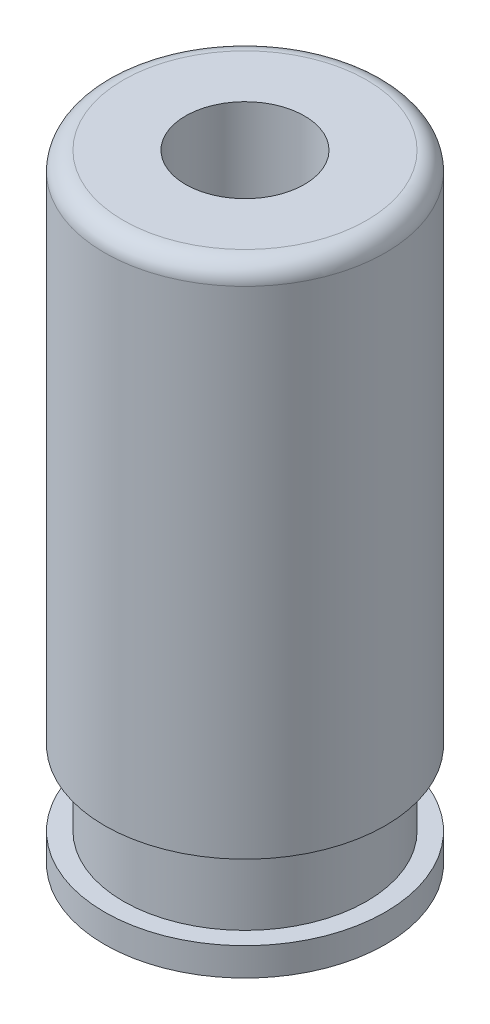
ISO-10303-21;
HEADER;
FILE_DESCRIPTION(('STEP AP214'),'2;1');
FILE_NAME('part.step','',(''),(''),'','','');
FILE_SCHEMA(('AUTOMOTIVE_DESIGN { 1 0 10303 214 1 1 1 1 }'));
ENDSEC;
DATA;
#1=APPLICATION_CONTEXT('core data for automotive mechanical design processes');
#2=APPLICATION_PROTOCOL_DEFINITION('international standard','automotive_design',2000,#1);
#3=PRODUCT_CONTEXT('',#1,'mechanical');
#4=PRODUCT('Part','Part','',(#3));
#5=PRODUCT_RELATED_PRODUCT_CATEGORY('part','',(#4));
#6=PRODUCT_DEFINITION_FORMATION('','',#4);
#7=PRODUCT_DEFINITION_CONTEXT('part definition',#1,'design');
#8=PRODUCT_DEFINITION('design','',#6,#7);
#9=PRODUCT_DEFINITION_SHAPE('','',#8);
#10=(LENGTH_UNIT() NAMED_UNIT(*) SI_UNIT(.MILLI.,.METRE.));
#11=(NAMED_UNIT(*) PLANE_ANGLE_UNIT() SI_UNIT($,.RADIAN.));
#12=(NAMED_UNIT(*) SI_UNIT($,.STERADIAN.) SOLID_ANGLE_UNIT());
#13=UNCERTAINTY_MEASURE_WITH_UNIT(LENGTH_MEASURE(1.E-05),#10,'distance_accuracy_value','');
#14=(GEOMETRIC_REPRESENTATION_CONTEXT(3) GLOBAL_UNCERTAINTY_ASSIGNED_CONTEXT((#13)) GLOBAL_UNIT_ASSIGNED_CONTEXT((#10,
#11,#12)) REPRESENTATION_CONTEXT('',''));
#15=CARTESIAN_POINT('',(0.,0.,0.));
#16=DIRECTION('',(0.,0.,1.));
#17=DIRECTION('',(1.,0.,0.));
#18=AXIS2_PLACEMENT_3D('',#15,#16,#17);
#19=CARTESIAN_POINT('',(0.,33.,0.));
#20=DIRECTION('',(0.,-1.,0.));
#21=DIRECTION('',(0.,0.,-1.));
#22=AXIS2_PLACEMENT_3D('',#19,#20,#21);
#23=CYLINDRICAL_SURFACE('',#22,7.5);
#24=CARTESIAN_POINT('',(0.,1.5,0.));
#25=DIRECTION('',(0.,-1.,0.));
#26=DIRECTION('',(0.,0.,-1.));
#27=AXIS2_PLACEMENT_3D('',#24,#25,#26);
#28=CIRCLE('',#27,7.5);
#29=CARTESIAN_POINT('',(0.,1.5,-7.5));
#30=VERTEX_POINT('',#29);
#31=EDGE_CURVE('E45',#30,#30,#28,.T.);
#32=ORIENTED_EDGE('',*,*,#31,.T.);
#33=EDGE_LOOP('',(#32));
#34=FACE_BOUND('',#33,.T.);
#35=CARTESIAN_POINT('',(0.,0.,0.));
#36=DIRECTION('',(0.,1.,0.));
#37=DIRECTION('',(0.,0.,1.));
#38=AXIS2_PLACEMENT_3D('',#35,#36,#37);
#39=CIRCLE('',#38,7.5);
#40=CARTESIAN_POINT('',(0.,0.,7.5));
#41=VERTEX_POINT('',#40);
#42=EDGE_CURVE('E41',#41,#41,#39,.T.);
#43=ORIENTED_EDGE('',*,*,#42,.T.);
#44=EDGE_LOOP('',(#43));
#45=FACE_BOUND('',#44,.T.);
#46=ADVANCED_FACE('F30',(#34,#45),#23,.T.);
#47=CARTESIAN_POINT('',(0.,0.,0.));
#48=DIRECTION('',(0.,1.,0.));
#49=DIRECTION('',(0.,0.,1.));
#50=AXIS2_PLACEMENT_3D('',#47,#48,#49);
#51=PLANE('',#50);
#52=ORIENTED_EDGE('',*,*,#42,.F.);
#53=EDGE_LOOP('',(#52));
#54=FACE_BOUND('',#53,.T.);
#55=ADVANCED_FACE('F88',(#54),#51,.F.);
#56=CARTESIAN_POINT('',(-8.5,1.5,0.));
#57=DIRECTION('',(0.,-1.,0.));
#58=DIRECTION('',(0.,0.,-1.));
#59=AXIS2_PLACEMENT_3D('',#56,#57,#58);
#60=PLANE('',#59);
#61=CARTESIAN_POINT('',(0.,1.5,0.));
#62=DIRECTION('',(0.,1.,0.));
#63=DIRECTION('',(0.,0.,1.));
#64=AXIS2_PLACEMENT_3D('',#61,#62,#63);
#65=CIRCLE('',#64,6.5);
#66=CARTESIAN_POINT('',(0.,1.5,6.5));
#67=VERTEX_POINT('',#66);
#68=EDGE_CURVE('E52',#67,#67,#65,.T.);
#69=ORIENTED_EDGE('',*,*,#68,.F.);
#70=EDGE_LOOP('',(#69));
#71=FACE_BOUND('',#70,.T.);
#72=ORIENTED_EDGE('',*,*,#31,.F.);
#73=EDGE_LOOP('',(#72));
#74=FACE_BOUND('',#73,.T.);
#75=ADVANCED_FACE('F93',(#71,#74),#60,.F.);
#76=CARTESIAN_POINT('',(-8.5,5.5,0.));
#77=DIRECTION('',(0.,1.,0.));
#78=DIRECTION('',(0.,0.,1.));
#79=AXIS2_PLACEMENT_3D('',#76,#77,#78);
#80=PLANE('',#79);
#81=CARTESIAN_POINT('',(0.,5.5,0.));
#82=DIRECTION('',(0.,1.,0.));
#83=DIRECTION('',(0.,0.,1.));
#84=AXIS2_PLACEMENT_3D('',#81,#82,#83);
#85=CIRCLE('',#84,6.5);
#86=CARTESIAN_POINT('',(0.,5.5,6.5));
#87=VERTEX_POINT('',#86);
#88=EDGE_CURVE('E56',#87,#87,#85,.T.);
#89=ORIENTED_EDGE('',*,*,#88,.T.);
#90=EDGE_LOOP('',(#89));
#91=FACE_BOUND('',#90,.T.);
#92=CARTESIAN_POINT('',(0.,5.5,0.));
#93=DIRECTION('',(0.,1.,0.));
#94=DIRECTION('',(0.,0.,1.));
#95=AXIS2_PLACEMENT_3D('',#92,#93,#94);
#96=CIRCLE('',#95,7.5);
#97=CARTESIAN_POINT('',(0.,5.5,7.5));
#98=VERTEX_POINT('',#97);
#99=EDGE_CURVE('E50',#98,#98,#96,.T.);
#100=ORIENTED_EDGE('',*,*,#99,.F.);
#101=EDGE_LOOP('',(#100));
#102=FACE_BOUND('',#101,.T.);
#103=ADVANCED_FACE('F83',(#91,#102),#80,.F.);
#104=CARTESIAN_POINT('',(0.,33.,0.));
#105=DIRECTION('',(0.,1.,0.));
#106=DIRECTION('',(0.,0.,1.));
#107=AXIS2_PLACEMENT_3D('',#104,#105,#106);
#108=CYLINDRICAL_SURFACE('',#107,6.5);
#109=ORIENTED_EDGE('',*,*,#88,.F.);
#110=EDGE_LOOP('',(#109));
#111=FACE_BOUND('',#110,.T.);
#112=ORIENTED_EDGE('',*,*,#68,.T.);
#113=EDGE_LOOP('',(#112));
#114=FACE_BOUND('',#113,.T.);
#115=ADVANCED_FACE('F77',(#111,#114),#108,.T.);
#116=CARTESIAN_POINT('',(0.,33.,0.));
#117=DIRECTION('',(0.,1.,0.));
#118=DIRECTION('',(0.,0.,1.));
#119=AXIS2_PLACEMENT_3D('',#116,#117,#118);
#120=PLANE('',#119);
#121=CARTESIAN_POINT('',(0.,33.,0.));
#122=DIRECTION('',(0.,1.,0.));
#123=DIRECTION('',(0.,0.,1.));
#124=AXIS2_PLACEMENT_3D('',#121,#122,#123);
#125=CIRCLE('',#124,6.5);
#126=CARTESIAN_POINT('',(0.,33.,6.5));
#127=VERTEX_POINT('',#126);
#128=EDGE_CURVE('E37',#127,#127,#125,.T.);
#129=ORIENTED_EDGE('',*,*,#128,.T.);
#130=EDGE_LOOP('',(#129));
#131=FACE_BOUND('',#130,.T.);
#132=CARTESIAN_POINT('',(0.,33.,0.));
#133=DIRECTION('',(0.,1.,0.));
#134=DIRECTION('',(0.,0.,1.));
#135=AXIS2_PLACEMENT_3D('',#132,#133,#134);
#136=CIRCLE('',#135,3.175);
#137=CARTESIAN_POINT('',(0.,33.,3.175));
#138=VERTEX_POINT('',#137);
#139=EDGE_CURVE('E60',#138,#138,#136,.T.);
#140=ORIENTED_EDGE('',*,*,#139,.F.);
#141=EDGE_LOOP('',(#140));
#142=FACE_BOUND('',#141,.T.);
#143=ADVANCED_FACE('F75',(#131,#142),#120,.T.);
#144=CARTESIAN_POINT('',(0.,32.,0.));
#145=DIRECTION('',(0.,1.,0.));
#146=DIRECTION('',(0.,0.,1.));
#147=AXIS2_PLACEMENT_3D('',#144,#145,#146);
#148=CIRCLE('',#147,7.5);
#149=CARTESIAN_POINT('',(0.,32.,7.5));
#150=VERTEX_POINT('',#149);
#151=EDGE_CURVE('E10',#150,#150,#148,.F.);
#152=ORIENTED_EDGE('',*,*,#151,.T.);
#153=EDGE_LOOP('',(#152));
#154=FACE_BOUND('',#153,.T.);
#155=ORIENTED_EDGE('',*,*,#99,.T.);
#156=EDGE_LOOP('',(#155));
#157=FACE_BOUND('',#156,.T.);
#158=ADVANCED_FACE('F71',(#154,#157),#23,.T.);
#159=CARTESIAN_POINT('',(0.,28.,0.));
#160=DIRECTION('',(0.,1.,0.));
#161=DIRECTION('',(0.,0.,1.));
#162=AXIS2_PLACEMENT_3D('',#159,#160,#161);
#163=CYLINDRICAL_SURFACE('',#162,3.175);
#164=CARTESIAN_POINT('',(0.,28.,0.));
#165=DIRECTION('',(0.,1.,0.));
#166=DIRECTION('',(0.,0.,1.));
#167=AXIS2_PLACEMENT_3D('',#164,#165,#166);
#168=CIRCLE('',#167,3.175);
#169=CARTESIAN_POINT('',(0.,28.,3.175));
#170=VERTEX_POINT('',#169);
#171=EDGE_CURVE('E59',#170,#170,#168,.T.);
#172=ORIENTED_EDGE('',*,*,#171,.F.);
#173=EDGE_LOOP('',(#172));
#174=FACE_BOUND('',#173,.T.);
#175=ORIENTED_EDGE('',*,*,#139,.T.);
#176=EDGE_LOOP('',(#175));
#177=FACE_BOUND('',#176,.T.);
#178=ADVANCED_FACE('F68',(#174,#177),#163,.F.);
#179=CARTESIAN_POINT('',(0.,28.,0.));
#180=DIRECTION('',(0.,1.,0.));
#181=DIRECTION('',(0.,0.,1.));
#182=AXIS2_PLACEMENT_3D('',#179,#180,#181);
#183=PLANE('',#182);
#184=ORIENTED_EDGE('',*,*,#171,.T.);
#185=EDGE_LOOP('',(#184));
#186=FACE_BOUND('',#185,.T.);
#187=ADVANCED_FACE('F66',(#186),#183,.T.);
#188=CARTESIAN_POINT('',(0.,32.,0.));
#189=DIRECTION('',(0.,1.,0.));
#190=DIRECTION('',(0.,0.,1.));
#191=AXIS2_PLACEMENT_3D('',#188,#189,#190);
#192=TOROIDAL_SURFACE('',#191,6.5,1.);
#193=ORIENTED_EDGE('',*,*,#151,.F.);
#194=EDGE_LOOP('',(#193));
#195=FACE_BOUND('',#194,.T.);
#196=ORIENTED_EDGE('',*,*,#128,.F.);
#197=EDGE_LOOP('',(#196));
#198=FACE_BOUND('',#197,.T.);
#199=ADVANCED_FACE('F32',(#195,#198),#192,.T.);
#200=CLOSED_SHELL('',(#46,#55,#75,#103,#115,#143,#158,#178,#187,#199));
#201=MANIFOLD_SOLID_BREP('B2',#200);
#202=ADVANCED_BREP_SHAPE_REPRESENTATION('',(#18,#201),#14);
#203=SHAPE_DEFINITION_REPRESENTATION(#9,#202);
ENDSEC;
END-ISO-10303-21;
